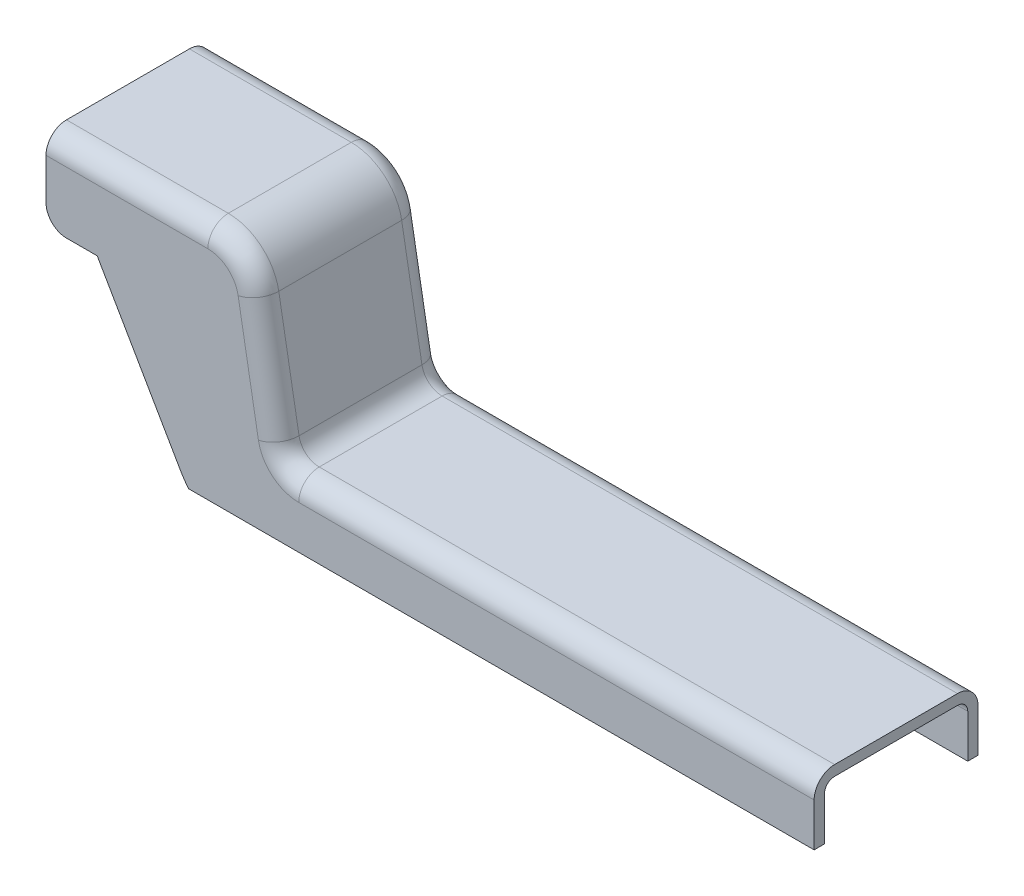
ISO-10303-21;
HEADER;
FILE_DESCRIPTION(('STEP AP214'),'2;1');
FILE_NAME('part.step','',(''),(''),'','','');
FILE_SCHEMA(('AUTOMOTIVE_DESIGN { 1 0 10303 214 1 1 1 1 }'));
ENDSEC;
DATA;
#1=APPLICATION_CONTEXT('core data for automotive mechanical design processes');
#2=APPLICATION_PROTOCOL_DEFINITION('international standard','automotive_design',2000,#1);
#3=PRODUCT_CONTEXT('',#1,'mechanical');
#4=PRODUCT('Part','Part','',(#3));
#5=PRODUCT_RELATED_PRODUCT_CATEGORY('part','',(#4));
#6=PRODUCT_DEFINITION_FORMATION('','',#4);
#7=PRODUCT_DEFINITION_CONTEXT('part definition',#1,'design');
#8=PRODUCT_DEFINITION('design','',#6,#7);
#9=PRODUCT_DEFINITION_SHAPE('','',#8);
#10=(LENGTH_UNIT() NAMED_UNIT(*) SI_UNIT(.MILLI.,.METRE.));
#11=(NAMED_UNIT(*) PLANE_ANGLE_UNIT() SI_UNIT($,.RADIAN.));
#12=(NAMED_UNIT(*) SI_UNIT($,.STERADIAN.) SOLID_ANGLE_UNIT());
#13=UNCERTAINTY_MEASURE_WITH_UNIT(LENGTH_MEASURE(1.E-05),#10,'distance_accuracy_value','');
#14=(GEOMETRIC_REPRESENTATION_CONTEXT(3) GLOBAL_UNCERTAINTY_ASSIGNED_CONTEXT((#13)) GLOBAL_UNIT_ASSIGNED_CONTEXT((#10,
#11,#12)) REPRESENTATION_CONTEXT('',''));
#15=CARTESIAN_POINT('',(0.,0.,0.));
#16=DIRECTION('',(0.,0.,1.));
#17=DIRECTION('',(1.,0.,0.));
#18=AXIS2_PLACEMENT_3D('',#15,#16,#17);
#19=CARTESIAN_POINT('',(-10.9776487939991,19.0138454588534,16.));
#20=DIRECTION('',(0.,1.,0.));
#21=DIRECTION('',(0.,0.,1.));
#22=AXIS2_PLACEMENT_3D('',#19,#20,#21);
#23=PLANE('',#22);
#24=DIRECTION('',(1.,0.,0.));
#25=VECTOR('',#24,1.);
#26=CARTESIAN_POINT('',(-13.9776487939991,19.0138454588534,1.));
#27=LINE('',#26,#25);
#28=CARTESIAN_POINT('',(-13.9776487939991,19.0138454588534,1.));
#29=VERTEX_POINT('',#28);
#30=CARTESIAN_POINT('',(-10.9776487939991,19.0138454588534,1.));
#31=VERTEX_POINT('',#30);
#32=EDGE_CURVE('E448',#29,#31,#27,.T.);
#33=ORIENTED_EDGE('',*,*,#32,.F.);
#34=DIRECTION('',(0.,0.,-1.));
#35=VECTOR('',#34,1.);
#36=CARTESIAN_POINT('',(-13.9776487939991,19.0138454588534,16.));
#37=LINE('',#36,#35);
#38=CARTESIAN_POINT('',(-13.9776487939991,19.0138454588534,0.));
#39=VERTEX_POINT('',#38);
#40=EDGE_CURVE('E304',#29,#39,#37,.T.);
#41=ORIENTED_EDGE('',*,*,#40,.T.);
#42=DIRECTION('',(1.,0.,0.));
#43=VECTOR('',#42,1.);
#44=CARTESIAN_POINT('',(-10.9776487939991,19.0138454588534,0.));
#45=LINE('',#44,#43);
#46=CARTESIAN_POINT('',(-10.9776487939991,19.0138454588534,0.));
#47=VERTEX_POINT('',#46);
#48=EDGE_CURVE('E411',#39,#47,#45,.T.);
#49=ORIENTED_EDGE('',*,*,#48,.T.);
#50=DIRECTION('',(0.,0.,-1.));
#51=VECTOR('',#50,1.);
#52=CARTESIAN_POINT('',(-10.9776487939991,19.0138454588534,16.));
#53=LINE('',#52,#51);
#54=EDGE_CURVE('E324',#31,#47,#53,.T.);
#55=ORIENTED_EDGE('',*,*,#54,.F.);
#56=EDGE_LOOP('',(#33,#41,#49,#55));
#57=FACE_BOUND('',#56,.T.);
#58=ADVANCED_FACE('F33',(#57),#23,.F.);
#59=CARTESIAN_POINT('',(-2.88675134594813,4.99999999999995,16.));
#60=DIRECTION('',(0.866025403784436,0.500000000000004,0.));
#61=DIRECTION('',(-0.500000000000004,0.866025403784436,0.));
#62=AXIS2_PLACEMENT_3D('',#59,#60,#61);
#63=PLANE('',#62);
#64=DIRECTION('',(0.500000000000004,-0.866025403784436,0.));
#65=VECTOR('',#64,1.);
#66=CARTESIAN_POINT('',(-12.5936741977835,21.8128835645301,1.));
#67=LINE('',#66,#65);
#68=CARTESIAN_POINT('',(-2.88675134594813,4.99999999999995,1.));
#69=VERTEX_POINT('',#68);
#70=EDGE_CURVE('E548',#31,#69,#67,.T.);
#71=ORIENTED_EDGE('',*,*,#70,.F.);
#72=ORIENTED_EDGE('',*,*,#54,.T.);
#73=DIRECTION('',(0.500000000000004,-0.866025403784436,0.));
#74=VECTOR('',#73,1.);
#75=CARTESIAN_POINT('',(-2.88675134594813,4.99999999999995,0.));
#76=LINE('',#75,#74);
#77=CARTESIAN_POINT('',(-2.88675134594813,4.99999999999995,0.));
#78=VERTEX_POINT('',#77);
#79=EDGE_CURVE('E293',#47,#78,#76,.T.);
#80=ORIENTED_EDGE('',*,*,#79,.T.);
#81=DIRECTION('',(0.,0.,-1.));
#82=VECTOR('',#81,1.);
#83=CARTESIAN_POINT('',(-2.88675134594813,4.99999999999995,16.));
#84=LINE('',#83,#82);
#85=EDGE_CURVE('E320',#69,#78,#84,.T.);
#86=ORIENTED_EDGE('',*,*,#85,.F.);
#87=EDGE_LOOP('',(#71,#72,#80,#86));
#88=FACE_BOUND('',#87,.T.);
#89=ADVANCED_FACE('F570',(#88),#63,.F.);
#90=CARTESIAN_POINT('',(5.77350269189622,10.,16.));
#91=DIRECTION('',(0.,0.,-1.));
#92=DIRECTION('',(-1.,0.,0.));
#93=AXIS2_PLACEMENT_3D('',#90,#91,#92);
#94=CYLINDRICAL_SURFACE('',#93,10.);
#95=CARTESIAN_POINT('',(5.77350269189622,10.,0.));
#96=DIRECTION('',(0.,0.,1.));
#97=DIRECTION('',(1.,0.,0.));
#98=AXIS2_PLACEMENT_3D('',#95,#96,#97);
#99=CIRCLE('',#98,10.);
#100=CARTESIAN_POINT('',(-2.05666971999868,3.78,0.));
#101=VERTEX_POINT('',#100);
#102=EDGE_CURVE('E288',#78,#101,#99,.T.);
#103=ORIENTED_EDGE('',*,*,#102,.T.);
#104=DIRECTION('',(0.,0.,-1.));
#105=VECTOR('',#104,1.);
#106=CARTESIAN_POINT('',(-2.05666971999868,3.78,16.));
#107=LINE('',#106,#105);
#108=CARTESIAN_POINT('',(-2.05666971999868,3.78,1.));
#109=VERTEX_POINT('',#108);
#110=EDGE_CURVE('E266',#101,#109,#107,.F.);
#111=ORIENTED_EDGE('',*,*,#110,.T.);
#112=CARTESIAN_POINT('',(5.77350269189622,10.,1.));
#113=DIRECTION('',(0.,0.,-1.));
#114=DIRECTION('',(-1.,0.,0.));
#115=AXIS2_PLACEMENT_3D('',#112,#113,#114);
#116=CIRCLE('',#115,10.);
#117=EDGE_CURVE('E518',#69,#109,#116,.F.);
#118=ORIENTED_EDGE('',*,*,#117,.F.);
#119=ORIENTED_EDGE('',*,*,#85,.T.);
#120=EDGE_LOOP('',(#103,#111,#118,#119));
#121=FACE_BOUND('',#120,.T.);
#122=ADVANCED_FACE('F574',(#121),#94,.T.);
#123=CARTESIAN_POINT('',(59.0223512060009,10.,16.));
#124=DIRECTION('',(-1.,0.,0.));
#125=DIRECTION('',(0.,-1.,0.));
#126=AXIS2_PLACEMENT_3D('',#123,#124,#125);
#127=PLANE('',#126);
#128=DIRECTION('',(0.,1.,0.));
#129=VECTOR('',#128,1.);
#130=CARTESIAN_POINT('',(59.0223512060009,10.,16.));
#131=LINE('',#130,#129);
#132=CARTESIAN_POINT('',(59.0223512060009,3.78,16.));
#133=VERTEX_POINT('',#132);
#134=CARTESIAN_POINT('',(59.0223512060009,8.,16.));
#135=VERTEX_POINT('',#134);
#136=EDGE_CURVE('E558',#133,#135,#131,.T.);
#137=ORIENTED_EDGE('',*,*,#136,.F.);
#138=DIRECTION('',(0.,0.,1.));
#139=VECTOR('',#138,1.);
#140=CARTESIAN_POINT('',(59.0223512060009,3.78,0.));
#141=LINE('',#140,#139);
#142=CARTESIAN_POINT('',(59.0223512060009,3.78,15.));
#143=VERTEX_POINT('',#142);
#144=EDGE_CURVE('E271',#143,#133,#141,.T.);
#145=ORIENTED_EDGE('',*,*,#144,.F.);
#146=DIRECTION('',(0.,1.,0.));
#147=VECTOR('',#146,1.);
#148=CARTESIAN_POINT('',(59.0223512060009,21.0138454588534,15.));
#149=LINE('',#148,#147);
#150=CARTESIAN_POINT('',(59.0223512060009,8.,15.));
#151=VERTEX_POINT('',#150);
#152=EDGE_CURVE('E524',#143,#151,#149,.T.);
#153=ORIENTED_EDGE('',*,*,#152,.T.);
#154=CARTESIAN_POINT('',(59.0223512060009,8.,14.));
#155=DIRECTION('',(-1.,0.,0.));
#156=DIRECTION('',(0.,-1.,0.));
#157=AXIS2_PLACEMENT_3D('',#154,#155,#156);
#158=CIRCLE('',#157,1.);
#159=CARTESIAN_POINT('',(59.0223512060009,9.,14.));
#160=VERTEX_POINT('',#159);
#161=EDGE_CURVE('E501',#160,#151,#158,.F.);
#162=ORIENTED_EDGE('',*,*,#161,.F.);
#163=DIRECTION('',(0.,0.,-1.));
#164=VECTOR('',#163,1.);
#165=CARTESIAN_POINT('',(59.0223512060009,9.,16.));
#166=LINE('',#165,#164);
#167=CARTESIAN_POINT('',(59.0223512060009,9.,2.));
#168=VERTEX_POINT('',#167);
#169=EDGE_CURVE('E453',#160,#168,#166,.T.);
#170=ORIENTED_EDGE('',*,*,#169,.T.);
#171=CARTESIAN_POINT('',(59.0223512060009,8.,2.));
#172=DIRECTION('',(-1.,0.,0.));
#173=DIRECTION('',(0.,-1.,0.));
#174=AXIS2_PLACEMENT_3D('',#171,#172,#173);
#175=CIRCLE('',#174,1.);
#176=CARTESIAN_POINT('',(59.0223512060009,8.,1.));
#177=VERTEX_POINT('',#176);
#178=EDGE_CURVE('E384',#177,#168,#175,.F.);
#179=ORIENTED_EDGE('',*,*,#178,.F.);
#180=DIRECTION('',(0.,1.,0.));
#181=VECTOR('',#180,1.);
#182=CARTESIAN_POINT('',(59.0223512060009,21.0138454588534,1.));
#183=LINE('',#182,#181);
#184=CARTESIAN_POINT('',(59.0223512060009,3.78,1.));
#185=VERTEX_POINT('',#184);
#186=EDGE_CURVE('E281',#185,#177,#183,.T.);
#187=ORIENTED_EDGE('',*,*,#186,.F.);
#188=CARTESIAN_POINT('',(59.0223512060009,3.78,0.));
#189=VERTEX_POINT('',#188);
#190=EDGE_CURVE('E56',#189,#185,#141,.T.);
#191=ORIENTED_EDGE('',*,*,#190,.F.);
#192=DIRECTION('',(0.,1.,0.));
#193=VECTOR('',#192,1.);
#194=CARTESIAN_POINT('',(59.0223512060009,10.,0.));
#195=LINE('',#194,#193);
#196=CARTESIAN_POINT('',(59.0223512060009,8.,0.));
#197=VERTEX_POINT('',#196);
#198=EDGE_CURVE('E278',#189,#197,#195,.T.);
#199=ORIENTED_EDGE('',*,*,#198,.T.);
#200=CARTESIAN_POINT('',(59.0223512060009,8.,2.));
#201=DIRECTION('',(-1.,0.,0.));
#202=DIRECTION('',(0.,-1.,0.));
#203=AXIS2_PLACEMENT_3D('',#200,#201,#202);
#204=CIRCLE('',#203,2.);
#205=CARTESIAN_POINT('',(59.0223512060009,10.,2.));
#206=VERTEX_POINT('',#205);
#207=EDGE_CURVE('E377',#197,#206,#204,.F.);
#208=ORIENTED_EDGE('',*,*,#207,.T.);
#209=DIRECTION('',(0.,0.,-1.));
#210=VECTOR('',#209,1.);
#211=CARTESIAN_POINT('',(59.0223512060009,10.,16.));
#212=LINE('',#211,#210);
#213=CARTESIAN_POINT('',(59.0223512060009,10.,14.));
#214=VERTEX_POINT('',#213);
#215=EDGE_CURVE('E317',#214,#206,#212,.T.);
#216=ORIENTED_EDGE('',*,*,#215,.F.);
#217=CARTESIAN_POINT('',(59.0223512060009,8.,14.));
#218=DIRECTION('',(-1.,0.,0.));
#219=DIRECTION('',(0.,-1.,0.));
#220=AXIS2_PLACEMENT_3D('',#217,#218,#219);
#221=CIRCLE('',#220,2.);
#222=EDGE_CURVE('E374',#214,#135,#221,.F.);
#223=ORIENTED_EDGE('',*,*,#222,.T.);
#224=EDGE_LOOP('',(#137,#145,#153,#162,#170,#179,#187,#191,#199,#208,#216,#223));
#225=FACE_BOUND('',#224,.T.);
#226=ADVANCED_FACE('F277',(#225),#127,.F.);
#227=CARTESIAN_POINT('',(-15.9776487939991,21.0138454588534,16.));
#228=DIRECTION('',(1.,0.,0.));
#229=DIRECTION('',(0.,0.,-1.));
#230=AXIS2_PLACEMENT_3D('',#227,#228,#229);
#231=PLANE('',#230);
#232=DIRECTION('',(0.,-1.,0.));
#233=VECTOR('',#232,1.);
#234=CARTESIAN_POINT('',(-15.9776487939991,21.0138454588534,1.));
#235=LINE('',#234,#233);
#236=CARTESIAN_POINT('',(-15.9776487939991,25.0138454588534,1.));
#237=VERTEX_POINT('',#236);
#238=CARTESIAN_POINT('',(-15.9776487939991,21.0138454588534,1.));
#239=VERTEX_POINT('',#238);
#240=EDGE_CURVE('E517',#237,#239,#235,.T.);
#241=ORIENTED_EDGE('',*,*,#240,.F.);
#242=CARTESIAN_POINT('',(-15.9776487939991,25.0138454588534,2.));
#243=DIRECTION('',(1.,0.,0.));
#244=DIRECTION('',(0.,0.,-1.));
#245=AXIS2_PLACEMENT_3D('',#242,#243,#244);
#246=CIRCLE('',#245,1.);
#247=CARTESIAN_POINT('',(-15.9776487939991,26.0138454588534,2.));
#248=VERTEX_POINT('',#247);
#249=EDGE_CURVE('E493',#248,#237,#246,.F.);
#250=ORIENTED_EDGE('',*,*,#249,.F.);
#251=DIRECTION('',(0.,0.,-1.));
#252=VECTOR('',#251,1.);
#253=CARTESIAN_POINT('',(-15.9776487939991,26.0138454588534,16.));
#254=LINE('',#253,#252);
#255=CARTESIAN_POINT('',(-15.9776487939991,26.0138454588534,14.));
#256=VERTEX_POINT('',#255);
#257=EDGE_CURVE('E464',#256,#248,#254,.T.);
#258=ORIENTED_EDGE('',*,*,#257,.F.);
#259=CARTESIAN_POINT('',(-15.9776487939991,25.0138454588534,14.));
#260=DIRECTION('',(1.,0.,0.));
#261=DIRECTION('',(0.,0.,-1.));
#262=AXIS2_PLACEMENT_3D('',#259,#260,#261);
#263=CIRCLE('',#262,1.);
#264=CARTESIAN_POINT('',(-15.9776487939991,25.0138454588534,15.));
#265=VERTEX_POINT('',#264);
#266=EDGE_CURVE('E475',#265,#256,#263,.F.);
#267=ORIENTED_EDGE('',*,*,#266,.F.);
#268=DIRECTION('',(0.,-1.,0.));
#269=VECTOR('',#268,1.);
#270=CARTESIAN_POINT('',(-15.9776487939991,21.0138454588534,15.));
#271=LINE('',#270,#269);
#272=CARTESIAN_POINT('',(-15.9776487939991,21.0138454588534,15.));
#273=VERTEX_POINT('',#272);
#274=EDGE_CURVE('E526',#265,#273,#271,.T.);
#275=ORIENTED_EDGE('',*,*,#274,.T.);
#276=DIRECTION('',(0.,0.,-1.));
#277=VECTOR('',#276,1.);
#278=CARTESIAN_POINT('',(-15.9776487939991,21.0138454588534,16.));
#279=LINE('',#278,#277);
#280=CARTESIAN_POINT('',(-15.9776487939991,21.0138454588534,16.));
#281=VERTEX_POINT('',#280);
#282=EDGE_CURVE('E305',#281,#273,#279,.T.);
#283=ORIENTED_EDGE('',*,*,#282,.F.);
#284=DIRECTION('',(0.,-1.,0.));
#285=VECTOR('',#284,1.);
#286=CARTESIAN_POINT('',(-15.9776487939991,21.0138454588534,16.));
#287=LINE('',#286,#285);
#288=CARTESIAN_POINT('',(-15.9776487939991,25.0138454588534,16.));
#289=VERTEX_POINT('',#288);
#290=EDGE_CURVE('E560',#289,#281,#287,.T.);
#291=ORIENTED_EDGE('',*,*,#290,.F.);
#292=CARTESIAN_POINT('',(-15.9776487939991,25.0138454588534,14.));
#293=DIRECTION('',(1.,0.,0.));
#294=DIRECTION('',(0.,0.,-1.));
#295=AXIS2_PLACEMENT_3D('',#292,#293,#294);
#296=CIRCLE('',#295,2.);
#297=CARTESIAN_POINT('',(-15.9776487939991,27.0138454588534,14.));
#298=VERTEX_POINT('',#297);
#299=EDGE_CURVE('E333',#289,#298,#296,.F.);
#300=ORIENTED_EDGE('',*,*,#299,.T.);
#301=DIRECTION('',(0.,0.,-1.));
#302=VECTOR('',#301,1.);
#303=CARTESIAN_POINT('',(-15.9776487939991,27.0138454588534,16.));
#304=LINE('',#303,#302);
#305=CARTESIAN_POINT('',(-15.9776487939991,27.0138454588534,2.));
#306=VERTEX_POINT('',#305);
#307=EDGE_CURVE('E308',#298,#306,#304,.T.);
#308=ORIENTED_EDGE('',*,*,#307,.T.);
#309=CARTESIAN_POINT('',(-15.9776487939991,25.0138454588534,2.));
#310=DIRECTION('',(1.,0.,0.));
#311=DIRECTION('',(0.,0.,-1.));
#312=AXIS2_PLACEMENT_3D('',#309,#310,#311);
#313=CIRCLE('',#312,2.);
#314=CARTESIAN_POINT('',(-15.9776487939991,25.0138454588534,0.));
#315=VERTEX_POINT('',#314);
#316=EDGE_CURVE('E335',#306,#315,#313,.F.);
#317=ORIENTED_EDGE('',*,*,#316,.T.);
#318=DIRECTION('',(0.,-1.,0.));
#319=VECTOR('',#318,1.);
#320=CARTESIAN_POINT('',(-15.9776487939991,21.0138454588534,0.));
#321=LINE('',#320,#319);
#322=CARTESIAN_POINT('',(-15.9776487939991,21.0138454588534,0.));
#323=VERTEX_POINT('',#322);
#324=EDGE_CURVE('E287',#315,#323,#321,.T.);
#325=ORIENTED_EDGE('',*,*,#324,.T.);
#326=EDGE_CURVE('E303',#239,#323,#279,.T.);
#327=ORIENTED_EDGE('',*,*,#326,.F.);
#328=EDGE_LOOP('',(#241,#250,#258,#267,#275,#283,#291,#300,#308,#317,#325,#327));
#329=FACE_BOUND('',#328,.T.);
#330=ADVANCED_FACE('F590',(#329),#231,.F.);
#331=CARTESIAN_POINT('',(-13.9776487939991,21.0138454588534,16.));
#332=DIRECTION('',(0.,0.,-1.));
#333=DIRECTION('',(-1.,0.,0.));
#334=AXIS2_PLACEMENT_3D('',#331,#332,#333);
#335=CYLINDRICAL_SURFACE('',#334,2.);
#336=CARTESIAN_POINT('',(-13.9776487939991,21.0138454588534,1.));
#337=DIRECTION('',(0.,0.,-1.));
#338=DIRECTION('',(-1.,0.,0.));
#339=AXIS2_PLACEMENT_3D('',#336,#337,#338);
#340=CIRCLE('',#339,2.);
#341=EDGE_CURVE('E535',#239,#29,#340,.F.);
#342=ORIENTED_EDGE('',*,*,#341,.F.);
#343=ORIENTED_EDGE('',*,*,#326,.T.);
#344=CARTESIAN_POINT('',(-13.9776487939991,21.0138454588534,0.));
#345=DIRECTION('',(0.,0.,1.));
#346=DIRECTION('',(-1.,0.,0.));
#347=AXIS2_PLACEMENT_3D('',#344,#345,#346);
#348=CIRCLE('',#347,2.);
#349=EDGE_CURVE('E291',#323,#39,#348,.T.);
#350=ORIENTED_EDGE('',*,*,#349,.T.);
#351=ORIENTED_EDGE('',*,*,#40,.F.);
#352=EDGE_LOOP('',(#342,#343,#350,#351));
#353=FACE_BOUND('',#352,.T.);
#354=ADVANCED_FACE('F586',(#353),#335,.T.);
#355=CARTESIAN_POINT('',(-13.9776487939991,19.0138454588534,16.));
#356=VERTEX_POINT('',#355);
#357=CARTESIAN_POINT('',(-13.9776487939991,19.0138454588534,15.));
#358=VERTEX_POINT('',#357);
#359=EDGE_CURVE('E300',#356,#358,#37,.T.);
#360=ORIENTED_EDGE('',*,*,#359,.T.);
#361=DIRECTION('',(1.,0.,0.));
#362=VECTOR('',#361,1.);
#363=CARTESIAN_POINT('',(-13.9776487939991,19.0138454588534,15.));
#364=LINE('',#363,#362);
#365=CARTESIAN_POINT('',(-10.9776487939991,19.0138454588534,15.));
#366=VERTEX_POINT('',#365);
#367=EDGE_CURVE('E532',#358,#366,#364,.T.);
#368=ORIENTED_EDGE('',*,*,#367,.T.);
#369=CARTESIAN_POINT('',(-10.9776487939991,19.0138454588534,16.));
#370=VERTEX_POINT('',#369);
#371=EDGE_CURVE('E325',#370,#366,#53,.T.);
#372=ORIENTED_EDGE('',*,*,#371,.F.);
#373=DIRECTION('',(1.,0.,0.));
#374=VECTOR('',#373,1.);
#375=CARTESIAN_POINT('',(-10.9776487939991,19.0138454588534,16.));
#376=LINE('',#375,#374);
#377=EDGE_CURVE('E299',#356,#370,#376,.T.);
#378=ORIENTED_EDGE('',*,*,#377,.F.);
#379=EDGE_LOOP('',(#360,#368,#372,#378));
#380=FACE_BOUND('',#379,.T.);
#381=ADVANCED_FACE('F665',(#380),#23,.F.);
#382=ORIENTED_EDGE('',*,*,#371,.T.);
#383=DIRECTION('',(0.500000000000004,-0.866025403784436,0.));
#384=VECTOR('',#383,1.);
#385=CARTESIAN_POINT('',(-12.5936741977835,21.8128835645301,15.));
#386=LINE('',#385,#384);
#387=CARTESIAN_POINT('',(-2.88675134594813,4.99999999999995,15.));
#388=VERTEX_POINT('',#387);
#389=EDGE_CURVE('E529',#366,#388,#386,.T.);
#390=ORIENTED_EDGE('',*,*,#389,.T.);
#391=CARTESIAN_POINT('',(-2.88675134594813,4.99999999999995,16.));
#392=VERTEX_POINT('',#391);
#393=EDGE_CURVE('E321',#392,#388,#84,.T.);
#394=ORIENTED_EDGE('',*,*,#393,.F.);
#395=DIRECTION('',(0.500000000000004,-0.866025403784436,0.));
#396=VECTOR('',#395,1.);
#397=CARTESIAN_POINT('',(-2.88675134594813,4.99999999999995,16.));
#398=LINE('',#397,#396);
#399=EDGE_CURVE('E554',#370,#392,#398,.T.);
#400=ORIENTED_EDGE('',*,*,#399,.F.);
#401=EDGE_LOOP('',(#382,#390,#394,#400));
#402=FACE_BOUND('',#401,.T.);
#403=ADVANCED_FACE('F667',(#402),#63,.F.);
#404=CARTESIAN_POINT('',(5.77350269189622,10.,15.));
#405=DIRECTION('',(0.,0.,-1.));
#406=DIRECTION('',(-1.,0.,0.));
#407=AXIS2_PLACEMENT_3D('',#404,#405,#406);
#408=CIRCLE('',#407,10.);
#409=CARTESIAN_POINT('',(-2.05666971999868,3.78,15.));
#410=VERTEX_POINT('',#409);
#411=EDGE_CURVE('E527',#388,#410,#408,.F.);
#412=ORIENTED_EDGE('',*,*,#411,.T.);
#413=DIRECTION('',(0.,0.,-1.));
#414=VECTOR('',#413,1.);
#415=CARTESIAN_POINT('',(-2.05666971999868,3.78,16.));
#416=LINE('',#415,#414);
#417=CARTESIAN_POINT('',(-2.05666971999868,3.78,16.));
#418=VERTEX_POINT('',#417);
#419=EDGE_CURVE('E48',#410,#418,#416,.F.);
#420=ORIENTED_EDGE('',*,*,#419,.T.);
#421=CARTESIAN_POINT('',(5.77350269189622,10.,16.));
#422=DIRECTION('',(0.,0.,1.));
#423=DIRECTION('',(1.,0.,0.));
#424=AXIS2_PLACEMENT_3D('',#421,#422,#423);
#425=CIRCLE('',#424,10.);
#426=EDGE_CURVE('E556',#392,#418,#425,.T.);
#427=ORIENTED_EDGE('',*,*,#426,.F.);
#428=ORIENTED_EDGE('',*,*,#393,.T.);
#429=EDGE_LOOP('',(#412,#420,#427,#428));
#430=FACE_BOUND('',#429,.T.);
#431=ADVANCED_FACE('F668',(#430),#94,.T.);
#432=CARTESIAN_POINT('',(7.02235120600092,10.,16.));
#433=DIRECTION('',(0.,-1.,0.));
#434=DIRECTION('',(1.,0.,0.));
#435=AXIS2_PLACEMENT_3D('',#432,#433,#434);
#436=PLANE('',#435);
#437=ORIENTED_EDGE('',*,*,#215,.T.);
#438=DIRECTION('',(-1.,0.,0.));
#439=VECTOR('',#438,1.);
#440=CARTESIAN_POINT('',(7.02235120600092,10.,2.));
#441=LINE('',#440,#439);
#442=CARTESIAN_POINT('',(8.70055046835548,10.,2.));
#443=VERTEX_POINT('',#442);
#444=EDGE_CURVE('E372',#206,#443,#441,.T.);
#445=ORIENTED_EDGE('',*,*,#444,.T.);
#446=DIRECTION('',(0.,0.,-1.));
#447=VECTOR('',#446,1.);
#448=CARTESIAN_POINT('',(8.70055046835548,10.,16.));
#449=LINE('',#448,#447);
#450=CARTESIAN_POINT('',(8.70055046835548,10.,14.));
#451=VERTEX_POINT('',#450);
#452=EDGE_CURVE('E370',#443,#451,#449,.F.);
#453=ORIENTED_EDGE('',*,*,#452,.T.);
#454=DIRECTION('',(-1.,0.,0.));
#455=VECTOR('',#454,1.);
#456=CARTESIAN_POINT('',(7.02235120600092,10.,14.));
#457=LINE('',#456,#455);
#458=EDGE_CURVE('E368',#451,#214,#457,.F.);
#459=ORIENTED_EDGE('',*,*,#458,.T.);
#460=EDGE_LOOP('',(#437,#445,#453,#459));
#461=FACE_BOUND('',#460,.T.);
#462=ADVANCED_FACE('F622',(#461),#436,.F.);
#463=CARTESIAN_POINT('',(4.75089181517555,22.882086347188,16.));
#464=DIRECTION('',(-0.984807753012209,-0.173648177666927,0.));
#465=DIRECTION('',(0.173648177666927,-0.984807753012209,0.));
#466=AXIS2_PLACEMENT_3D('',#463,#464,#465);
#467=PLANE('',#466);
#468=DIRECTION('',(0.,0.,-1.));
#469=VECTOR('',#468,1.);
#470=CARTESIAN_POINT('',(6.73093496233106,11.6527036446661,0.));
#471=LINE('',#470,#469);
#472=CARTESIAN_POINT('',(6.73093496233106,11.6527036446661,14.));
#473=VERTEX_POINT('',#472);
#474=CARTESIAN_POINT('',(6.73093496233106,11.6527036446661,2.));
#475=VERTEX_POINT('',#474);
#476=EDGE_CURVE('E353',#473,#475,#471,.T.);
#477=ORIENTED_EDGE('',*,*,#476,.T.);
#478=DIRECTION('',(-0.173648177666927,0.984807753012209,0.));
#479=VECTOR('',#478,1.);
#480=CARTESIAN_POINT('',(4.75089181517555,22.882086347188,2.));
#481=LINE('',#480,#479);
#482=CARTESIAN_POINT('',(4.75089181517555,22.882086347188,2.));
#483=VERTEX_POINT('',#482);
#484=EDGE_CURVE('E355',#475,#483,#481,.T.);
#485=ORIENTED_EDGE('',*,*,#484,.T.);
#486=DIRECTION('',(0.,0.,-1.));
#487=VECTOR('',#486,1.);
#488=CARTESIAN_POINT('',(4.75089181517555,22.882086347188,16.));
#489=LINE('',#488,#487);
#490=CARTESIAN_POINT('',(4.75089181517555,22.882086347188,14.));
#491=VERTEX_POINT('',#490);
#492=EDGE_CURVE('E314',#491,#483,#489,.T.);
#493=ORIENTED_EDGE('',*,*,#492,.F.);
#494=DIRECTION('',(-0.173648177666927,0.984807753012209,0.));
#495=VECTOR('',#494,1.);
#496=CARTESIAN_POINT('',(4.75089181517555,22.882086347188,14.));
#497=LINE('',#496,#495);
#498=EDGE_CURVE('E351',#491,#473,#497,.F.);
#499=ORIENTED_EDGE('',*,*,#498,.T.);
#500=EDGE_LOOP('',(#477,#485,#493,#499));
#501=FACE_BOUND('',#500,.T.);
#502=ADVANCED_FACE('F636',(#501),#467,.F.);
#503=CARTESIAN_POINT('',(-0.173146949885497,22.0138454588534,16.));
#504=DIRECTION('',(0.,0.,-1.));
#505=DIRECTION('',(-1.,0.,0.));
#506=AXIS2_PLACEMENT_3D('',#503,#504,#505);
#507=CYLINDRICAL_SURFACE('',#506,5.);
#508=ORIENTED_EDGE('',*,*,#492,.T.);
#509=CARTESIAN_POINT('',(-0.173146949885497,22.0138454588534,2.));
#510=DIRECTION('',(0.,0.,-1.));
#511=DIRECTION('',(-1.,0.,0.));
#512=AXIS2_PLACEMENT_3D('',#509,#510,#511);
#513=CIRCLE('',#512,5.);
#514=CARTESIAN_POINT('',(-0.173146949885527,27.0138454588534,2.));
#515=VERTEX_POINT('',#514);
#516=EDGE_CURVE('E349',#483,#515,#513,.F.);
#517=ORIENTED_EDGE('',*,*,#516,.T.);
#518=DIRECTION('',(0.,0.,-1.));
#519=VECTOR('',#518,1.);
#520=CARTESIAN_POINT('',(-0.173146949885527,27.0138454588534,16.));
#521=LINE('',#520,#519);
#522=CARTESIAN_POINT('',(-0.173146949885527,27.0138454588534,14.));
#523=VERTEX_POINT('',#522);
#524=EDGE_CURVE('E311',#523,#515,#521,.T.);
#525=ORIENTED_EDGE('',*,*,#524,.F.);
#526=CARTESIAN_POINT('',(-0.173146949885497,22.0138454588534,14.));
#527=DIRECTION('',(0.,0.,-1.));
#528=DIRECTION('',(-1.,0.,0.));
#529=AXIS2_PLACEMENT_3D('',#526,#527,#528);
#530=CIRCLE('',#529,5.);
#531=EDGE_CURVE('E347',#523,#491,#530,.T.);
#532=ORIENTED_EDGE('',*,*,#531,.T.);
#533=EDGE_LOOP('',(#508,#517,#525,#532));
#534=FACE_BOUND('',#533,.T.);
#535=ADVANCED_FACE('F746',(#534),#507,.T.);
#536=CARTESIAN_POINT('',(-15.9776487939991,27.0138454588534,16.));
#537=DIRECTION('',(0.,-1.,0.));
#538=DIRECTION('',(0.,0.,-1.));
#539=AXIS2_PLACEMENT_3D('',#536,#537,#538);
#540=PLANE('',#539);
#541=ORIENTED_EDGE('',*,*,#524,.T.);
#542=DIRECTION('',(-1.,0.,0.));
#543=VECTOR('',#542,1.);
#544=CARTESIAN_POINT('',(-15.9776487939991,27.0138454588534,2.));
#545=LINE('',#544,#543);
#546=EDGE_CURVE('E330',#515,#306,#545,.T.);
#547=ORIENTED_EDGE('',*,*,#546,.T.);
#548=ORIENTED_EDGE('',*,*,#307,.F.);
#549=DIRECTION('',(-1.,0.,0.));
#550=VECTOR('',#549,1.);
#551=CARTESIAN_POINT('',(-15.9776487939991,27.0138454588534,14.));
#552=LINE('',#551,#550);
#553=EDGE_CURVE('E328',#298,#523,#552,.F.);
#554=ORIENTED_EDGE('',*,*,#553,.T.);
#555=EDGE_LOOP('',(#541,#547,#548,#554));
#556=FACE_BOUND('',#555,.T.);
#557=ADVANCED_FACE('F596',(#556),#540,.F.);
#558=ORIENTED_EDGE('',*,*,#282,.T.);
#559=CARTESIAN_POINT('',(-13.9776487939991,21.0138454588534,15.));
#560=DIRECTION('',(0.,0.,-1.));
#561=DIRECTION('',(-1.,0.,0.));
#562=AXIS2_PLACEMENT_3D('',#559,#560,#561);
#563=CIRCLE('',#562,2.);
#564=EDGE_CURVE('E536',#273,#358,#563,.F.);
#565=ORIENTED_EDGE('',*,*,#564,.T.);
#566=ORIENTED_EDGE('',*,*,#359,.F.);
#567=CARTESIAN_POINT('',(-13.9776487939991,21.0138454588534,16.));
#568=DIRECTION('',(0.,0.,1.));
#569=DIRECTION('',(-1.,0.,0.));
#570=AXIS2_PLACEMENT_3D('',#567,#568,#569);
#571=CIRCLE('',#570,2.);
#572=EDGE_CURVE('E562',#281,#356,#571,.T.);
#573=ORIENTED_EDGE('',*,*,#572,.F.);
#574=EDGE_LOOP('',(#558,#565,#566,#573));
#575=FACE_BOUND('',#574,.T.);
#576=ADVANCED_FACE('F660',(#575),#335,.T.);
#577=CARTESIAN_POINT('',(-13.9776487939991,21.0138454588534,16.));
#578=DIRECTION('',(0.,0.,-1.));
#579=DIRECTION('',(-1.,0.,0.));
#580=AXIS2_PLACEMENT_3D('',#577,#578,#579);
#581=PLANE('',#580);
#582=ORIENTED_EDGE('',*,*,#426,.T.);
#583=DIRECTION('',(-1.,0.,0.));
#584=VECTOR('',#583,1.);
#585=CARTESIAN_POINT('',(-2.18238401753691,3.78,16.));
#586=LINE('',#585,#584);
#587=EDGE_CURVE('E272',#133,#418,#586,.T.);
#588=ORIENTED_EDGE('',*,*,#587,.F.);
#589=ORIENTED_EDGE('',*,*,#136,.T.);
#590=DIRECTION('',(-1.,0.,0.));
#591=VECTOR('',#590,1.);
#592=CARTESIAN_POINT('',(-13.9776487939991,8.,16.));
#593=LINE('',#592,#591);
#594=CARTESIAN_POINT('',(8.70055046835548,8.,16.));
#595=VERTEX_POINT('',#594);
#596=EDGE_CURVE('E360',#135,#595,#593,.T.);
#597=ORIENTED_EDGE('',*,*,#596,.T.);
#598=CARTESIAN_POINT('',(8.70055046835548,12.,16.));
#599=DIRECTION('',(0.,0.,-1.));
#600=DIRECTION('',(-1.,0.,0.));
#601=AXIS2_PLACEMENT_3D('',#598,#599,#600);
#602=CIRCLE('',#601,4.);
#603=CARTESIAN_POINT('',(4.76131945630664,11.3054072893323,16.));
#604=VERTEX_POINT('',#603);
#605=EDGE_CURVE('E357',#604,#595,#602,.F.);
#606=ORIENTED_EDGE('',*,*,#605,.F.);
#607=DIRECTION('',(-0.173648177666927,0.984807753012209,0.));
#608=VECTOR('',#607,1.);
#609=CARTESIAN_POINT('',(2.53602971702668,23.9256525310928,16.));
#610=LINE('',#609,#608);
#611=CARTESIAN_POINT('',(2.78127630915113,22.5347899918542,16.));
#612=VERTEX_POINT('',#611);
#613=EDGE_CURVE('E362',#604,#612,#610,.T.);
#614=ORIENTED_EDGE('',*,*,#613,.T.);
#615=CARTESIAN_POINT('',(-0.173146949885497,22.0138454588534,16.));
#616=DIRECTION('',(0.,0.,-1.));
#617=DIRECTION('',(-1.,0.,0.));
#618=AXIS2_PLACEMENT_3D('',#615,#616,#617);
#619=CIRCLE('',#618,3.);
#620=CARTESIAN_POINT('',(-0.173146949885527,25.0138454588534,16.));
#621=VERTEX_POINT('',#620);
#622=EDGE_CURVE('E364',#612,#621,#619,.F.);
#623=ORIENTED_EDGE('',*,*,#622,.T.);
#624=DIRECTION('',(-1.,0.,0.));
#625=VECTOR('',#624,1.);
#626=CARTESIAN_POINT('',(-13.9776487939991,25.0138454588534,16.));
#627=LINE('',#626,#625);
#628=EDGE_CURVE('E366',#621,#289,#627,.T.);
#629=ORIENTED_EDGE('',*,*,#628,.T.);
#630=ORIENTED_EDGE('',*,*,#290,.T.);
#631=ORIENTED_EDGE('',*,*,#572,.T.);
#632=ORIENTED_EDGE('',*,*,#377,.T.);
#633=ORIENTED_EDGE('',*,*,#399,.T.);
#634=EDGE_LOOP('',(#582,#588,#589,#597,#606,#614,#623,#629,#630,#631,#632,#633));
#635=FACE_BOUND('',#634,.T.);
#636=ADVANCED_FACE('F646',(#635),#581,.F.);
#637=CARTESIAN_POINT('',(-13.9776487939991,21.0138454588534,0.));
#638=DIRECTION('',(0.,0.,-1.));
#639=DIRECTION('',(-1.,0.,0.));
#640=AXIS2_PLACEMENT_3D('',#637,#638,#639);
#641=PLANE('',#640);
#642=DIRECTION('',(-1.,0.,0.));
#643=VECTOR('',#642,1.);
#644=CARTESIAN_POINT('',(-2.18238401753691,3.78,0.));
#645=LINE('',#644,#643);
#646=EDGE_CURVE('E263',#189,#101,#645,.T.);
#647=ORIENTED_EDGE('',*,*,#646,.T.);
#648=ORIENTED_EDGE('',*,*,#102,.F.);
#649=ORIENTED_EDGE('',*,*,#79,.F.);
#650=ORIENTED_EDGE('',*,*,#48,.F.);
#651=ORIENTED_EDGE('',*,*,#349,.F.);
#652=ORIENTED_EDGE('',*,*,#324,.F.);
#653=DIRECTION('',(-1.,0.,0.));
#654=VECTOR('',#653,1.);
#655=CARTESIAN_POINT('',(-0.173146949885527,25.0138454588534,0.));
#656=LINE('',#655,#654);
#657=CARTESIAN_POINT('',(-0.173146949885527,25.0138454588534,0.));
#658=VERTEX_POINT('',#657);
#659=EDGE_CURVE('E345',#315,#658,#656,.F.);
#660=ORIENTED_EDGE('',*,*,#659,.T.);
#661=CARTESIAN_POINT('',(-0.173146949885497,22.0138454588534,0.));
#662=DIRECTION('',(0.,0.,-1.));
#663=DIRECTION('',(-1.,0.,0.));
#664=AXIS2_PLACEMENT_3D('',#661,#662,#663);
#665=CIRCLE('',#664,3.);
#666=CARTESIAN_POINT('',(2.78127630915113,22.5347899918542,0.));
#667=VERTEX_POINT('',#666);
#668=EDGE_CURVE('E343',#658,#667,#665,.T.);
#669=ORIENTED_EDGE('',*,*,#668,.T.);
#670=DIRECTION('',(-0.173648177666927,0.984807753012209,0.));
#671=VECTOR('',#670,1.);
#672=CARTESIAN_POINT('',(5.0527356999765,9.65270364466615,0.));
#673=LINE('',#672,#671);
#674=CARTESIAN_POINT('',(4.76131945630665,11.3054072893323,0.));
#675=VERTEX_POINT('',#674);
#676=EDGE_CURVE('E341',#667,#675,#673,.F.);
#677=ORIENTED_EDGE('',*,*,#676,.T.);
#678=CARTESIAN_POINT('',(8.70055046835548,12.,0.));
#679=DIRECTION('',(0.,0.,-1.));
#680=DIRECTION('',(-1.,0.,0.));
#681=AXIS2_PLACEMENT_3D('',#678,#679,#680);
#682=CIRCLE('',#681,4.);
#683=CARTESIAN_POINT('',(8.70055046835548,8.,0.));
#684=VERTEX_POINT('',#683);
#685=EDGE_CURVE('E338',#684,#675,#682,.T.);
#686=ORIENTED_EDGE('',*,*,#685,.F.);
#687=DIRECTION('',(-1.,0.,0.));
#688=VECTOR('',#687,1.);
#689=CARTESIAN_POINT('',(59.0223512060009,8.,0.));
#690=LINE('',#689,#688);
#691=EDGE_CURVE('E285',#684,#197,#690,.F.);
#692=ORIENTED_EDGE('',*,*,#691,.T.);
#693=ORIENTED_EDGE('',*,*,#198,.F.);
#694=EDGE_LOOP('',(#647,#648,#649,#650,#651,#652,#660,#669,#677,#686,#692,#693));
#695=FACE_BOUND('',#694,.T.);
#696=ADVANCED_FACE('F283',(#695),#641,.T.);
#697=CARTESIAN_POINT('',(-13.9776487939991,25.0138454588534,14.));
#698=DIRECTION('',(-1.,0.,0.));
#699=DIRECTION('',(0.,0.,1.));
#700=AXIS2_PLACEMENT_3D('',#697,#698,#699);
#701=CYLINDRICAL_SURFACE('',#700,2.);
#702=ORIENTED_EDGE('',*,*,#299,.F.);
#703=ORIENTED_EDGE('',*,*,#628,.F.);
#704=CARTESIAN_POINT('',(-0.173146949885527,25.0138454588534,14.));
#705=DIRECTION('',(1.,0.,0.));
#706=DIRECTION('',(0.,0.,-1.));
#707=AXIS2_PLACEMENT_3D('',#704,#705,#706);
#708=CIRCLE('',#707,2.);
#709=EDGE_CURVE('E408',#523,#621,#708,.T.);
#710=ORIENTED_EDGE('',*,*,#709,.F.);
#711=ORIENTED_EDGE('',*,*,#553,.F.);
#712=EDGE_LOOP('',(#702,#703,#710,#711));
#713=FACE_BOUND('',#712,.T.);
#714=ADVANCED_FACE('F35',(#713),#701,.T.);
#715=CARTESIAN_POINT('',(-0.173146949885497,22.0138454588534,14.));
#716=DIRECTION('',(0.,0.,-1.));
#717=DIRECTION('',(-1.,0.,0.));
#718=AXIS2_PLACEMENT_3D('',#715,#716,#717);
#719=TOROIDAL_SURFACE('',#718,3.,2.);
#720=ORIENTED_EDGE('',*,*,#709,.T.);
#721=ORIENTED_EDGE('',*,*,#622,.F.);
#722=CARTESIAN_POINT('',(2.78127630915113,22.5347899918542,14.));
#723=DIRECTION('',(0.173648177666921,-0.98480775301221,0.));
#724=DIRECTION('',(0.98480775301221,0.173648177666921,0.));
#725=AXIS2_PLACEMENT_3D('',#722,#723,#724);
#726=CIRCLE('',#725,2.);
#727=EDGE_CURVE('E405',#491,#612,#726,.T.);
#728=ORIENTED_EDGE('',*,*,#727,.F.);
#729=ORIENTED_EDGE('',*,*,#531,.F.);
#730=EDGE_LOOP('',(#720,#721,#728,#729));
#731=FACE_BOUND('',#730,.T.);
#732=ADVANCED_FACE('F649',(#731),#719,.T.);
#733=CARTESIAN_POINT('',(-13.9776487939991,8.,14.));
#734=DIRECTION('',(-1.,0.,0.));
#735=DIRECTION('',(0.,-1.,0.));
#736=AXIS2_PLACEMENT_3D('',#733,#734,#735);
#737=CYLINDRICAL_SURFACE('',#736,2.);
#738=ORIENTED_EDGE('',*,*,#222,.F.);
#739=ORIENTED_EDGE('',*,*,#458,.F.);
#740=CARTESIAN_POINT('',(8.70055046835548,8.,14.));
#741=DIRECTION('',(-1.,0.,0.));
#742=DIRECTION('',(0.,0.,1.));
#743=AXIS2_PLACEMENT_3D('',#740,#741,#742);
#744=CIRCLE('',#743,2.);
#745=EDGE_CURVE('E402',#595,#451,#744,.T.);
#746=ORIENTED_EDGE('',*,*,#745,.F.);
#747=ORIENTED_EDGE('',*,*,#596,.F.);
#748=EDGE_LOOP('',(#738,#739,#746,#747));
#749=FACE_BOUND('',#748,.T.);
#750=ADVANCED_FACE('F627',(#749),#737,.T.);
#751=CARTESIAN_POINT('',(2.53602971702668,23.9256525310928,14.));
#752=DIRECTION('',(-0.173648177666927,0.984807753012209,0.));
#753=DIRECTION('',(-0.984807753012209,-0.173648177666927,0.));
#754=AXIS2_PLACEMENT_3D('',#751,#752,#753);
#755=CYLINDRICAL_SURFACE('',#754,2.);
#756=ORIENTED_EDGE('',*,*,#727,.T.);
#757=ORIENTED_EDGE('',*,*,#613,.F.);
#758=CARTESIAN_POINT('',(4.76131945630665,11.3054072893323,14.));
#759=DIRECTION('',(0.173648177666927,-0.984807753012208,0.));
#760=DIRECTION('',(0.984807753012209,0.173648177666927,0.));
#761=AXIS2_PLACEMENT_3D('',#758,#759,#760);
#762=CIRCLE('',#761,2.);
#763=EDGE_CURVE('E399',#473,#604,#762,.T.);
#764=ORIENTED_EDGE('',*,*,#763,.F.);
#765=ORIENTED_EDGE('',*,*,#498,.F.);
#766=EDGE_LOOP('',(#756,#757,#764,#765));
#767=FACE_BOUND('',#766,.T.);
#768=ADVANCED_FACE('F643',(#767),#755,.T.);
#769=CARTESIAN_POINT('',(8.70055046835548,12.,14.));
#770=DIRECTION('',(0.,0.,-1.));
#771=DIRECTION('',(-1.,0.,0.));
#772=AXIS2_PLACEMENT_3D('',#769,#770,#771);
#773=TOROIDAL_SURFACE('',#772,4.,2.);
#774=ORIENTED_EDGE('',*,*,#605,.T.);
#775=ORIENTED_EDGE('',*,*,#745,.T.);
#776=CARTESIAN_POINT('',(8.70055046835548,12.,14.));
#777=DIRECTION('',(0.,0.,-1.));
#778=DIRECTION('',(-1.,0.,0.));
#779=AXIS2_PLACEMENT_3D('',#776,#777,#778);
#780=CIRCLE('',#779,2.);
#781=EDGE_CURVE('E396',#473,#451,#780,.F.);
#782=ORIENTED_EDGE('',*,*,#781,.F.);
#783=ORIENTED_EDGE('',*,*,#763,.T.);
#784=EDGE_LOOP('',(#774,#775,#782,#783));
#785=FACE_BOUND('',#784,.T.);
#786=ADVANCED_FACE('F631',(#785),#773,.T.);
#787=CARTESIAN_POINT('',(7.02235120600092,8.,2.));
#788=DIRECTION('',(1.,0.,0.));
#789=DIRECTION('',(0.,1.,0.));
#790=AXIS2_PLACEMENT_3D('',#787,#788,#789);
#791=CYLINDRICAL_SURFACE('',#790,2.);
#792=ORIENTED_EDGE('',*,*,#207,.F.);
#793=ORIENTED_EDGE('',*,*,#691,.F.);
#794=CARTESIAN_POINT('',(8.70055046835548,8.,2.));
#795=DIRECTION('',(-1.,0.,0.));
#796=DIRECTION('',(0.,0.,1.));
#797=AXIS2_PLACEMENT_3D('',#794,#795,#796);
#798=CIRCLE('',#797,2.);
#799=EDGE_CURVE('E393',#443,#684,#798,.T.);
#800=ORIENTED_EDGE('',*,*,#799,.F.);
#801=ORIENTED_EDGE('',*,*,#444,.F.);
#802=EDGE_LOOP('',(#792,#793,#800,#801));
#803=FACE_BOUND('',#802,.T.);
#804=ADVANCED_FACE('F617',(#803),#791,.T.);
#805=CARTESIAN_POINT('',(8.70055046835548,12.,16.));
#806=DIRECTION('',(0.,0.,1.));
#807=DIRECTION('',(1.,0.,0.));
#808=AXIS2_PLACEMENT_3D('',#805,#806,#807);
#809=CYLINDRICAL_SURFACE('',#808,2.);
#810=ORIENTED_EDGE('',*,*,#781,.T.);
#811=ORIENTED_EDGE('',*,*,#452,.F.);
#812=CARTESIAN_POINT('',(8.70055046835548,12.,2.));
#813=DIRECTION('',(0.,0.,-1.));
#814=DIRECTION('',(-1.,0.,0.));
#815=AXIS2_PLACEMENT_3D('',#812,#813,#814);
#816=CIRCLE('',#815,2.);
#817=EDGE_CURVE('E390',#475,#443,#816,.F.);
#818=ORIENTED_EDGE('',*,*,#817,.F.);
#819=ORIENTED_EDGE('',*,*,#476,.F.);
#820=EDGE_LOOP('',(#810,#811,#818,#819));
#821=FACE_BOUND('',#820,.T.);
#822=ADVANCED_FACE('F634',(#821),#809,.F.);
#823=CARTESIAN_POINT('',(8.70055046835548,12.,2.));
#824=DIRECTION('',(0.,0.,-1.));
#825=DIRECTION('',(-1.,0.,0.));
#826=AXIS2_PLACEMENT_3D('',#823,#824,#825);
#827=TOROIDAL_SURFACE('',#826,4.,2.);
#828=ORIENTED_EDGE('',*,*,#799,.T.);
#829=ORIENTED_EDGE('',*,*,#685,.T.);
#830=CARTESIAN_POINT('',(4.76131945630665,11.3054072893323,2.));
#831=DIRECTION('',(0.173648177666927,-0.984807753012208,0.));
#832=DIRECTION('',(0.984807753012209,0.173648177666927,0.));
#833=AXIS2_PLACEMENT_3D('',#830,#831,#832);
#834=CIRCLE('',#833,2.);
#835=EDGE_CURVE('E387',#475,#675,#834,.F.);
#836=ORIENTED_EDGE('',*,*,#835,.F.);
#837=ORIENTED_EDGE('',*,*,#817,.T.);
#838=EDGE_LOOP('',(#828,#829,#836,#837));
#839=FACE_BOUND('',#838,.T.);
#840=ADVANCED_FACE('F613',(#839),#827,.T.);
#841=CARTESIAN_POINT('',(2.78127630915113,22.5347899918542,2.));
#842=DIRECTION('',(0.173648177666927,-0.984807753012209,0.));
#843=DIRECTION('',(0.984807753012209,0.173648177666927,0.));
#844=AXIS2_PLACEMENT_3D('',#841,#842,#843);
#845=CYLINDRICAL_SURFACE('',#844,2.);
#846=ORIENTED_EDGE('',*,*,#835,.T.);
#847=ORIENTED_EDGE('',*,*,#676,.F.);
#848=CARTESIAN_POINT('',(2.78127630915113,22.5347899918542,2.));
#849=DIRECTION('',(-0.173648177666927,0.984807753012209,0.));
#850=DIRECTION('',(-0.984807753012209,-0.173648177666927,0.));
#851=AXIS2_PLACEMENT_3D('',#848,#849,#850);
#852=CIRCLE('',#851,2.);
#853=EDGE_CURVE('E383',#483,#667,#852,.T.);
#854=ORIENTED_EDGE('',*,*,#853,.F.);
#855=ORIENTED_EDGE('',*,*,#484,.F.);
#856=EDGE_LOOP('',(#846,#847,#854,#855));
#857=FACE_BOUND('',#856,.T.);
#858=ADVANCED_FACE('F609',(#857),#845,.T.);
#859=CARTESIAN_POINT('',(-0.173146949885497,22.0138454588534,2.));
#860=DIRECTION('',(0.,0.,-1.));
#861=DIRECTION('',(-1.,0.,0.));
#862=AXIS2_PLACEMENT_3D('',#859,#860,#861);
#863=TOROIDAL_SURFACE('',#862,3.,2.);
#864=ORIENTED_EDGE('',*,*,#853,.T.);
#865=ORIENTED_EDGE('',*,*,#668,.F.);
#866=CARTESIAN_POINT('',(-0.173146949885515,25.0138454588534,2.));
#867=DIRECTION('',(-1.,0.,0.));
#868=DIRECTION('',(0.,-1.,0.));
#869=AXIS2_PLACEMENT_3D('',#866,#867,#868);
#870=CIRCLE('',#869,2.);
#871=EDGE_CURVE('E380',#515,#658,#870,.T.);
#872=ORIENTED_EDGE('',*,*,#871,.F.);
#873=ORIENTED_EDGE('',*,*,#516,.F.);
#874=EDGE_LOOP('',(#864,#865,#872,#873));
#875=FACE_BOUND('',#874,.T.);
#876=ADVANCED_FACE('F605',(#875),#863,.T.);
#877=CARTESIAN_POINT('',(-15.9776487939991,25.0138454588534,2.));
#878=DIRECTION('',(1.,0.,0.));
#879=DIRECTION('',(0.,0.,-1.));
#880=AXIS2_PLACEMENT_3D('',#877,#878,#879);
#881=CYLINDRICAL_SURFACE('',#880,2.);
#882=ORIENTED_EDGE('',*,*,#871,.T.);
#883=ORIENTED_EDGE('',*,*,#659,.F.);
#884=ORIENTED_EDGE('',*,*,#316,.F.);
#885=ORIENTED_EDGE('',*,*,#546,.F.);
#886=EDGE_LOOP('',(#882,#883,#884,#885));
#887=FACE_BOUND('',#886,.T.);
#888=ADVANCED_FACE('F594',(#887),#881,.T.);
#889=CARTESIAN_POINT('',(7.02235120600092,9.,16.));
#890=DIRECTION('',(0.,-1.,0.));
#891=DIRECTION('',(1.,0.,0.));
#892=AXIS2_PLACEMENT_3D('',#889,#890,#891);
#893=PLANE('',#892);
#894=ORIENTED_EDGE('',*,*,#169,.F.);
#895=DIRECTION('',(1.,0.,0.));
#896=VECTOR('',#895,1.);
#897=CARTESIAN_POINT('',(7.02235120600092,9.,14.));
#898=LINE('',#897,#896);
#899=CARTESIAN_POINT('',(8.70055046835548,9.,14.));
#900=VERTEX_POINT('',#899);
#901=EDGE_CURVE('E437',#900,#160,#898,.T.);
#902=ORIENTED_EDGE('',*,*,#901,.F.);
#903=DIRECTION('',(0.,0.,1.));
#904=VECTOR('',#903,1.);
#905=CARTESIAN_POINT('',(8.70055046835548,9.,16.));
#906=LINE('',#905,#904);
#907=CARTESIAN_POINT('',(8.70055046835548,9.,2.));
#908=VERTEX_POINT('',#907);
#909=EDGE_CURVE('E502',#908,#900,#906,.T.);
#910=ORIENTED_EDGE('',*,*,#909,.F.);
#911=DIRECTION('',(1.,0.,0.));
#912=VECTOR('',#911,1.);
#913=CARTESIAN_POINT('',(7.02235120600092,9.,2.));
#914=LINE('',#913,#912);
#915=EDGE_CURVE('E499',#168,#908,#914,.F.);
#916=ORIENTED_EDGE('',*,*,#915,.F.);
#917=EDGE_LOOP('',(#894,#902,#910,#916));
#918=FACE_BOUND('',#917,.T.);
#919=ADVANCED_FACE('F711',(#918),#893,.T.);
#920=CARTESIAN_POINT('',(3.76608406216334,22.7084381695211,16.));
#921=DIRECTION('',(-0.984807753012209,-0.173648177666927,0.));
#922=DIRECTION('',(0.173648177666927,-0.984807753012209,0.));
#923=AXIS2_PLACEMENT_3D('',#920,#921,#922);
#924=PLANE('',#923);
#925=DIRECTION('',(0.,0.,1.));
#926=VECTOR('',#925,1.);
#927=CARTESIAN_POINT('',(5.74612720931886,11.4790554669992,16.));
#928=LINE('',#927,#926);
#929=CARTESIAN_POINT('',(5.74612720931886,11.4790554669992,14.));
#930=VERTEX_POINT('',#929);
#931=CARTESIAN_POINT('',(5.74612720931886,11.4790554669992,1.99999999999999));
#932=VERTEX_POINT('',#931);
#933=EDGE_CURVE('E467',#930,#932,#928,.F.);
#934=ORIENTED_EDGE('',*,*,#933,.F.);
#935=DIRECTION('',(0.173648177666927,-0.984807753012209,0.));
#936=VECTOR('',#935,1.);
#937=CARTESIAN_POINT('',(3.76608406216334,22.7084381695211,14.));
#938=LINE('',#937,#936);
#939=CARTESIAN_POINT('',(3.76608406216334,22.7084381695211,14.));
#940=VERTEX_POINT('',#939);
#941=EDGE_CURVE('E460',#940,#930,#938,.T.);
#942=ORIENTED_EDGE('',*,*,#941,.F.);
#943=DIRECTION('',(0.,0.,-1.));
#944=VECTOR('',#943,1.);
#945=CARTESIAN_POINT('',(3.76608406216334,22.7084381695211,16.));
#946=LINE('',#945,#944);
#947=CARTESIAN_POINT('',(3.76608406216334,22.7084381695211,1.99999999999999));
#948=VERTEX_POINT('',#947);
#949=EDGE_CURVE('E454',#940,#948,#946,.T.);
#950=ORIENTED_EDGE('',*,*,#949,.T.);
#951=DIRECTION('',(0.173648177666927,-0.984807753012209,0.));
#952=VECTOR('',#951,1.);
#953=CARTESIAN_POINT('',(3.76608406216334,22.7084381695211,1.99999999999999));
#954=LINE('',#953,#952);
#955=EDGE_CURVE('E443',#932,#948,#954,.F.);
#956=ORIENTED_EDGE('',*,*,#955,.F.);
#957=EDGE_LOOP('',(#934,#942,#950,#956));
#958=FACE_BOUND('',#957,.T.);
#959=ADVANCED_FACE('F695',(#958),#924,.T.);
#960=CARTESIAN_POINT('',(-0.173146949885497,22.0138454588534,16.));
#961=DIRECTION('',(0.,0.,-1.));
#962=DIRECTION('',(-1.,0.,0.));
#963=AXIS2_PLACEMENT_3D('',#960,#961,#962);
#964=CYLINDRICAL_SURFACE('',#963,4.);
#965=ORIENTED_EDGE('',*,*,#949,.F.);
#966=CARTESIAN_POINT('',(-0.173146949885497,22.0138454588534,14.));
#967=DIRECTION('',(0.,0.,-1.));
#968=DIRECTION('',(-1.,0.,0.));
#969=AXIS2_PLACEMENT_3D('',#966,#967,#968);
#970=CIRCLE('',#969,4.);
#971=CARTESIAN_POINT('',(-0.173146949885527,26.0138454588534,14.));
#972=VERTEX_POINT('',#971);
#973=EDGE_CURVE('E461',#972,#940,#970,.T.);
#974=ORIENTED_EDGE('',*,*,#973,.F.);
#975=DIRECTION('',(0.,0.,-1.));
#976=VECTOR('',#975,1.);
#977=CARTESIAN_POINT('',(-0.173146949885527,26.0138454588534,16.));
#978=LINE('',#977,#976);
#979=CARTESIAN_POINT('',(-0.173146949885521,26.0138454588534,2.));
#980=VERTEX_POINT('',#979);
#981=EDGE_CURVE('E457',#972,#980,#978,.T.);
#982=ORIENTED_EDGE('',*,*,#981,.T.);
#983=CARTESIAN_POINT('',(-0.173146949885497,22.0138454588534,2.));
#984=DIRECTION('',(0.,0.,-1.));
#985=DIRECTION('',(-1.,0.,0.));
#986=AXIS2_PLACEMENT_3D('',#983,#984,#985);
#987=CIRCLE('',#986,4.);
#988=EDGE_CURVE('E458',#948,#980,#987,.F.);
#989=ORIENTED_EDGE('',*,*,#988,.F.);
#990=EDGE_LOOP('',(#965,#974,#982,#989));
#991=FACE_BOUND('',#990,.T.);
#992=ADVANCED_FACE('F718',(#991),#964,.F.);
#993=CARTESIAN_POINT('',(-15.9776487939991,26.0138454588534,16.));
#994=DIRECTION('',(0.,-1.,0.));
#995=DIRECTION('',(0.,0.,-1.));
#996=AXIS2_PLACEMENT_3D('',#993,#994,#995);
#997=PLANE('',#996);
#998=ORIENTED_EDGE('',*,*,#981,.F.);
#999=DIRECTION('',(1.,0.,0.));
#1000=VECTOR('',#999,1.);
#1001=CARTESIAN_POINT('',(-15.9776487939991,26.0138454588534,14.));
#1002=LINE('',#1001,#1000);
#1003=EDGE_CURVE('E450',#256,#972,#1002,.T.);
#1004=ORIENTED_EDGE('',*,*,#1003,.F.);
#1005=ORIENTED_EDGE('',*,*,#257,.T.);
#1006=DIRECTION('',(1.,0.,0.));
#1007=VECTOR('',#1006,1.);
#1008=CARTESIAN_POINT('',(-15.9776487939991,26.0138454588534,2.));
#1009=LINE('',#1008,#1007);
#1010=EDGE_CURVE('E452',#980,#248,#1009,.F.);
#1011=ORIENTED_EDGE('',*,*,#1010,.F.);
#1012=EDGE_LOOP('',(#998,#1004,#1005,#1011));
#1013=FACE_BOUND('',#1012,.T.);
#1014=ADVANCED_FACE('F826',(#1013),#997,.T.);
#1015=CARTESIAN_POINT('',(-13.9776487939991,21.0138454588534,15.));
#1016=DIRECTION('',(0.,0.,-1.));
#1017=DIRECTION('',(-1.,0.,0.));
#1018=AXIS2_PLACEMENT_3D('',#1015,#1016,#1017);
#1019=PLANE('',#1018);
#1020=DIRECTION('',(1.,0.,0.));
#1021=VECTOR('',#1020,1.);
#1022=CARTESIAN_POINT('',(-13.9776487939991,3.78,15.));
#1023=LINE('',#1022,#1021);
#1024=EDGE_CURVE('E419',#410,#143,#1023,.T.);
#1025=ORIENTED_EDGE('',*,*,#1024,.F.);
#1026=ORIENTED_EDGE('',*,*,#411,.F.);
#1027=ORIENTED_EDGE('',*,*,#389,.F.);
#1028=ORIENTED_EDGE('',*,*,#367,.F.);
#1029=ORIENTED_EDGE('',*,*,#564,.F.);
#1030=ORIENTED_EDGE('',*,*,#274,.F.);
#1031=DIRECTION('',(-1.,0.,0.));
#1032=VECTOR('',#1031,1.);
#1033=CARTESIAN_POINT('',(-13.9776487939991,25.0138454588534,15.));
#1034=LINE('',#1033,#1032);
#1035=CARTESIAN_POINT('',(-0.173146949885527,25.0138454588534,15.));
#1036=VERTEX_POINT('',#1035);
#1037=EDGE_CURVE('E434',#1036,#265,#1034,.T.);
#1038=ORIENTED_EDGE('',*,*,#1037,.F.);
#1039=CARTESIAN_POINT('',(-0.173146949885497,22.0138454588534,15.));
#1040=DIRECTION('',(0.,0.,-1.));
#1041=DIRECTION('',(-1.,0.,0.));
#1042=AXIS2_PLACEMENT_3D('',#1039,#1040,#1041);
#1043=CIRCLE('',#1042,3.);
#1044=CARTESIAN_POINT('',(2.78127630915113,22.5347899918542,15.));
#1045=VERTEX_POINT('',#1044);
#1046=EDGE_CURVE('E432',#1045,#1036,#1043,.F.);
#1047=ORIENTED_EDGE('',*,*,#1046,.F.);
#1048=DIRECTION('',(-0.173648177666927,0.984807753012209,0.));
#1049=VECTOR('',#1048,1.);
#1050=CARTESIAN_POINT('',(2.53602971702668,23.9256525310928,15.));
#1051=LINE('',#1050,#1049);
#1052=CARTESIAN_POINT('',(4.76131945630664,11.3054072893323,15.));
#1053=VERTEX_POINT('',#1052);
#1054=EDGE_CURVE('E435',#1053,#1045,#1051,.T.);
#1055=ORIENTED_EDGE('',*,*,#1054,.F.);
#1056=CARTESIAN_POINT('',(8.70055046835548,12.,15.));
#1057=DIRECTION('',(0.,0.,-1.));
#1058=DIRECTION('',(-1.,0.,0.));
#1059=AXIS2_PLACEMENT_3D('',#1056,#1057,#1058);
#1060=CIRCLE('',#1059,4.);
#1061=CARTESIAN_POINT('',(8.70055046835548,8.,15.));
#1062=VERTEX_POINT('',#1061);
#1063=EDGE_CURVE('E440',#1053,#1062,#1060,.F.);
#1064=ORIENTED_EDGE('',*,*,#1063,.T.);
#1065=DIRECTION('',(-1.,0.,0.));
#1066=VECTOR('',#1065,1.);
#1067=CARTESIAN_POINT('',(-13.9776487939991,8.,15.));
#1068=LINE('',#1067,#1066);
#1069=EDGE_CURVE('E438',#151,#1062,#1068,.T.);
#1070=ORIENTED_EDGE('',*,*,#1069,.F.);
#1071=ORIENTED_EDGE('',*,*,#152,.F.);
#1072=EDGE_LOOP('',(#1025,#1026,#1027,#1028,#1029,#1030,#1038,#1047,#1055,#1064,#1070,#1071));
#1073=FACE_BOUND('',#1072,.T.);
#1074=CARTESIAN_POINT('',(-4.97764879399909,16.5138454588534,15.));
#1075=DIRECTION('',(0.,0.,-1.));
#1076=DIRECTION('',(-1.,0.,0.));
#1077=AXIS2_PLACEMENT_3D('',#1074,#1075,#1076);
#1078=CIRCLE('',#1077,1.);
#1079=CARTESIAN_POINT('',(-5.97764879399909,16.5138454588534,15.));
#1080=VERTEX_POINT('',#1079);
#1081=EDGE_CURVE('E41',#1080,#1080,#1078,.T.);
#1082=ORIENTED_EDGE('',*,*,#1081,.F.);
#1083=EDGE_LOOP('',(#1082));
#1084=FACE_BOUND('',#1083,.T.);
#1085=CARTESIAN_POINT('',(-13.9776487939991,23.5138454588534,15.));
#1086=DIRECTION('',(0.,0.,-1.));
#1087=DIRECTION('',(-1.,0.,0.));
#1088=AXIS2_PLACEMENT_3D('',#1085,#1086,#1087);
#1089=CIRCLE('',#1088,1.);
#1090=CARTESIAN_POINT('',(-14.9776487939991,23.5138454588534,15.));
#1091=VERTEX_POINT('',#1090);
#1092=EDGE_CURVE('E379',#1091,#1091,#1089,.T.);
#1093=ORIENTED_EDGE('',*,*,#1092,.F.);
#1094=EDGE_LOOP('',(#1093));
#1095=FACE_BOUND('',#1094,.T.);
#1096=ADVANCED_FACE('F676',(#1073,#1084,#1095),#1019,.T.);
#1097=CARTESIAN_POINT('',(-13.9776487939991,21.0138454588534,1.));
#1098=DIRECTION('',(0.,0.,-1.));
#1099=DIRECTION('',(-1.,0.,0.));
#1100=AXIS2_PLACEMENT_3D('',#1097,#1098,#1099);
#1101=PLANE('',#1100);
#1102=CARTESIAN_POINT('',(-4.97764879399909,16.5138454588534,1.));
#1103=DIRECTION('',(0.,0.,-1.));
#1104=DIRECTION('',(-1.,0.,0.));
#1105=AXIS2_PLACEMENT_3D('',#1102,#1103,#1104);
#1106=CIRCLE('',#1105,1.);
#1107=CARTESIAN_POINT('',(-5.97764879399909,16.5138454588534,1.));
#1108=VERTEX_POINT('',#1107);
#1109=EDGE_CURVE('E415',#1108,#1108,#1106,.T.);
#1110=ORIENTED_EDGE('',*,*,#1109,.T.);
#1111=EDGE_LOOP('',(#1110));
#1112=FACE_BOUND('',#1111,.T.);
#1113=CARTESIAN_POINT('',(-13.9776487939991,23.5138454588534,1.));
#1114=DIRECTION('',(0.,0.,-1.));
#1115=DIRECTION('',(-1.,0.,0.));
#1116=AXIS2_PLACEMENT_3D('',#1113,#1114,#1115);
#1117=CIRCLE('',#1116,1.);
#1118=CARTESIAN_POINT('',(-14.9776487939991,23.5138454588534,1.));
#1119=VERTEX_POINT('',#1118);
#1120=EDGE_CURVE('E412',#1119,#1119,#1117,.T.);
#1121=ORIENTED_EDGE('',*,*,#1120,.T.);
#1122=EDGE_LOOP('',(#1121));
#1123=FACE_BOUND('',#1122,.T.);
#1124=ORIENTED_EDGE('',*,*,#117,.T.);
#1125=DIRECTION('',(1.,0.,0.));
#1126=VECTOR('',#1125,1.);
#1127=CARTESIAN_POINT('',(-13.9776487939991,3.78,1.));
#1128=LINE('',#1127,#1126);
#1129=EDGE_CURVE('E12',#109,#185,#1128,.T.);
#1130=ORIENTED_EDGE('',*,*,#1129,.T.);
#1131=ORIENTED_EDGE('',*,*,#186,.T.);
#1132=DIRECTION('',(-1.,0.,0.));
#1133=VECTOR('',#1132,1.);
#1134=CARTESIAN_POINT('',(-13.9776487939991,8.,1.));
#1135=LINE('',#1134,#1133);
#1136=CARTESIAN_POINT('',(8.70055046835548,8.,1.));
#1137=VERTEX_POINT('',#1136);
#1138=EDGE_CURVE('E490',#1137,#177,#1135,.F.);
#1139=ORIENTED_EDGE('',*,*,#1138,.F.);
#1140=CARTESIAN_POINT('',(8.70055046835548,12.,1.));
#1141=DIRECTION('',(0.,0.,-1.));
#1142=DIRECTION('',(-1.,0.,0.));
#1143=AXIS2_PLACEMENT_3D('',#1140,#1141,#1142);
#1144=CIRCLE('',#1143,4.);
#1145=CARTESIAN_POINT('',(4.76131945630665,11.3054072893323,1.));
#1146=VERTEX_POINT('',#1145);
#1147=EDGE_CURVE('E487',#1137,#1146,#1144,.T.);
#1148=ORIENTED_EDGE('',*,*,#1147,.T.);
#1149=DIRECTION('',(0.173648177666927,-0.984807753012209,0.));
#1150=VECTOR('',#1149,1.);
#1151=CARTESIAN_POINT('',(2.78127630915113,22.5347899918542,1.));
#1152=LINE('',#1151,#1150);
#1153=CARTESIAN_POINT('',(2.78127630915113,22.5347899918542,1.));
#1154=VERTEX_POINT('',#1153);
#1155=EDGE_CURVE('E482',#1154,#1146,#1152,.T.);
#1156=ORIENTED_EDGE('',*,*,#1155,.F.);
#1157=CARTESIAN_POINT('',(-0.173146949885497,22.0138454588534,1.));
#1158=DIRECTION('',(0.,0.,-1.));
#1159=DIRECTION('',(-1.,0.,0.));
#1160=AXIS2_PLACEMENT_3D('',#1157,#1158,#1159);
#1161=CIRCLE('',#1160,3.);
#1162=CARTESIAN_POINT('',(-0.173146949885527,25.0138454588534,1.));
#1163=VERTEX_POINT('',#1162);
#1164=EDGE_CURVE('E480',#1163,#1154,#1161,.T.);
#1165=ORIENTED_EDGE('',*,*,#1164,.F.);
#1166=DIRECTION('',(-1.,0.,0.));
#1167=VECTOR('',#1166,1.);
#1168=CARTESIAN_POINT('',(-13.9776487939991,25.0138454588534,1.));
#1169=LINE('',#1168,#1167);
#1170=EDGE_CURVE('E466',#237,#1163,#1169,.F.);
#1171=ORIENTED_EDGE('',*,*,#1170,.F.);
#1172=ORIENTED_EDGE('',*,*,#240,.T.);
#1173=ORIENTED_EDGE('',*,*,#341,.T.);
#1174=ORIENTED_EDGE('',*,*,#32,.T.);
#1175=ORIENTED_EDGE('',*,*,#70,.T.);
#1176=EDGE_LOOP('',(#1124,#1130,#1131,#1139,#1148,#1156,#1165,#1171,#1172,#1173,#1174,#1175));
#1177=FACE_BOUND('',#1176,.T.);
#1178=ADVANCED_FACE('F577',(#1112,#1123,#1177),#1101,.F.);
#1179=CARTESIAN_POINT('',(-13.9776487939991,25.0138454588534,14.));
#1180=DIRECTION('',(-1.,0.,0.));
#1181=DIRECTION('',(0.,0.,1.));
#1182=AXIS2_PLACEMENT_3D('',#1179,#1180,#1181);
#1183=CYLINDRICAL_SURFACE('',#1182,1.);
#1184=ORIENTED_EDGE('',*,*,#266,.T.);
#1185=ORIENTED_EDGE('',*,*,#1003,.T.);
#1186=CARTESIAN_POINT('',(-0.173146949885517,25.0138454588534,14.));
#1187=DIRECTION('',(-1.,0.,0.));
#1188=DIRECTION('',(0.,-1.,0.));
#1189=AXIS2_PLACEMENT_3D('',#1186,#1187,#1188);
#1190=CIRCLE('',#1189,1.);
#1191=EDGE_CURVE('E445',#972,#1036,#1190,.F.);
#1192=ORIENTED_EDGE('',*,*,#1191,.T.);
#1193=ORIENTED_EDGE('',*,*,#1037,.T.);
#1194=EDGE_LOOP('',(#1184,#1185,#1192,#1193));
#1195=FACE_BOUND('',#1194,.T.);
#1196=ADVANCED_FACE('F843',(#1195),#1183,.F.);
#1197=CARTESIAN_POINT('',(-0.173146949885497,22.0138454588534,14.));
#1198=DIRECTION('',(0.,0.,-1.));
#1199=DIRECTION('',(-1.,0.,0.));
#1200=AXIS2_PLACEMENT_3D('',#1197,#1198,#1199);
#1201=TOROIDAL_SURFACE('',#1200,3.,1.);
#1202=ORIENTED_EDGE('',*,*,#1191,.F.);
#1203=ORIENTED_EDGE('',*,*,#973,.T.);
#1204=CARTESIAN_POINT('',(2.78127630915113,22.5347899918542,14.));
#1205=DIRECTION('',(-0.173648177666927,0.984807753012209,0.));
#1206=DIRECTION('',(-0.984807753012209,-0.173648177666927,0.));
#1207=AXIS2_PLACEMENT_3D('',#1204,#1205,#1206);
#1208=CIRCLE('',#1207,1.);
#1209=EDGE_CURVE('E449',#940,#1045,#1208,.F.);
#1210=ORIENTED_EDGE('',*,*,#1209,.T.);
#1211=ORIENTED_EDGE('',*,*,#1046,.T.);
#1212=EDGE_LOOP('',(#1202,#1203,#1210,#1211));
#1213=FACE_BOUND('',#1212,.T.);
#1214=ADVANCED_FACE('F848',(#1213),#1201,.F.);
#1215=CARTESIAN_POINT('',(-13.9776487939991,8.,14.));
#1216=DIRECTION('',(-1.,0.,0.));
#1217=DIRECTION('',(0.,-1.,0.));
#1218=AXIS2_PLACEMENT_3D('',#1215,#1216,#1217);
#1219=CYLINDRICAL_SURFACE('',#1218,1.);
#1220=ORIENTED_EDGE('',*,*,#161,.T.);
#1221=ORIENTED_EDGE('',*,*,#1069,.T.);
#1222=CARTESIAN_POINT('',(8.70055046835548,8.,14.));
#1223=DIRECTION('',(1.,0.,0.));
#1224=DIRECTION('',(0.,1.,0.));
#1225=AXIS2_PLACEMENT_3D('',#1222,#1223,#1224);
#1226=CIRCLE('',#1225,1.);
#1227=EDGE_CURVE('E473',#1062,#900,#1226,.F.);
#1228=ORIENTED_EDGE('',*,*,#1227,.T.);
#1229=ORIENTED_EDGE('',*,*,#901,.T.);
#1230=EDGE_LOOP('',(#1220,#1221,#1228,#1229));
#1231=FACE_BOUND('',#1230,.T.);
#1232=ADVANCED_FACE('F681',(#1231),#1219,.F.);
#1233=CARTESIAN_POINT('',(2.53602971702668,23.9256525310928,14.));
#1234=DIRECTION('',(-0.173648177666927,0.984807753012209,0.));
#1235=DIRECTION('',(-0.984807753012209,-0.173648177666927,0.));
#1236=AXIS2_PLACEMENT_3D('',#1233,#1234,#1235);
#1237=CYLINDRICAL_SURFACE('',#1236,1.);
#1238=ORIENTED_EDGE('',*,*,#1209,.F.);
#1239=ORIENTED_EDGE('',*,*,#941,.T.);
#1240=CARTESIAN_POINT('',(4.76131945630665,11.3054072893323,14.));
#1241=DIRECTION('',(0.173648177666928,-0.984807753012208,0.));
#1242=DIRECTION('',(0.984807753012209,0.173648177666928,0.));
#1243=AXIS2_PLACEMENT_3D('',#1240,#1241,#1242);
#1244=CIRCLE('',#1243,1.);
#1245=EDGE_CURVE('E507',#930,#1053,#1244,.T.);
#1246=ORIENTED_EDGE('',*,*,#1245,.T.);
#1247=ORIENTED_EDGE('',*,*,#1054,.T.);
#1248=EDGE_LOOP('',(#1238,#1239,#1246,#1247));
#1249=FACE_BOUND('',#1248,.T.);
#1250=ADVANCED_FACE('F869',(#1249),#1237,.F.);
#1251=CARTESIAN_POINT('',(8.70055046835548,12.,14.));
#1252=DIRECTION('',(0.,0.,-1.));
#1253=DIRECTION('',(-1.,0.,0.));
#1254=AXIS2_PLACEMENT_3D('',#1251,#1252,#1253);
#1255=TOROIDAL_SURFACE('',#1254,4.,1.);
#1256=ORIENTED_EDGE('',*,*,#1063,.F.);
#1257=ORIENTED_EDGE('',*,*,#1245,.F.);
#1258=CARTESIAN_POINT('',(8.70055046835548,12.,14.));
#1259=DIRECTION('',(0.,0.,1.));
#1260=DIRECTION('',(1.,0.,0.));
#1261=AXIS2_PLACEMENT_3D('',#1258,#1259,#1260);
#1262=CIRCLE('',#1261,3.);
#1263=EDGE_CURVE('E497',#930,#900,#1262,.T.);
#1264=ORIENTED_EDGE('',*,*,#1263,.T.);
#1265=ORIENTED_EDGE('',*,*,#1227,.F.);
#1266=EDGE_LOOP('',(#1256,#1257,#1264,#1265));
#1267=FACE_BOUND('',#1266,.T.);
#1268=ADVANCED_FACE('F683',(#1267),#1255,.F.);
#1269=CARTESIAN_POINT('',(7.02235120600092,8.,2.));
#1270=DIRECTION('',(1.,0.,0.));
#1271=DIRECTION('',(0.,1.,0.));
#1272=AXIS2_PLACEMENT_3D('',#1269,#1270,#1271);
#1273=CYLINDRICAL_SURFACE('',#1272,1.);
#1274=ORIENTED_EDGE('',*,*,#178,.T.);
#1275=ORIENTED_EDGE('',*,*,#915,.T.);
#1276=CARTESIAN_POINT('',(8.70055046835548,8.,2.));
#1277=DIRECTION('',(1.,0.,0.));
#1278=DIRECTION('',(0.,1.,0.));
#1279=AXIS2_PLACEMENT_3D('',#1276,#1277,#1278);
#1280=CIRCLE('',#1279,1.);
#1281=EDGE_CURVE('E494',#908,#1137,#1280,.F.);
#1282=ORIENTED_EDGE('',*,*,#1281,.T.);
#1283=ORIENTED_EDGE('',*,*,#1138,.T.);
#1284=EDGE_LOOP('',(#1274,#1275,#1282,#1283));
#1285=FACE_BOUND('',#1284,.T.);
#1286=ADVANCED_FACE('F707',(#1285),#1273,.F.);
#1287=CARTESIAN_POINT('',(8.70055046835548,12.,16.));
#1288=DIRECTION('',(0.,0.,1.));
#1289=DIRECTION('',(1.,0.,0.));
#1290=AXIS2_PLACEMENT_3D('',#1287,#1288,#1289);
#1291=CYLINDRICAL_SURFACE('',#1290,3.);
#1292=ORIENTED_EDGE('',*,*,#1263,.F.);
#1293=ORIENTED_EDGE('',*,*,#933,.T.);
#1294=CARTESIAN_POINT('',(8.70055046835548,12.,2.));
#1295=DIRECTION('',(0.,0.,-1.));
#1296=DIRECTION('',(-1.,0.,0.));
#1297=AXIS2_PLACEMENT_3D('',#1294,#1295,#1296);
#1298=CIRCLE('',#1297,3.);
#1299=EDGE_CURVE('E498',#932,#908,#1298,.F.);
#1300=ORIENTED_EDGE('',*,*,#1299,.T.);
#1301=ORIENTED_EDGE('',*,*,#909,.T.);
#1302=EDGE_LOOP('',(#1292,#1293,#1300,#1301));
#1303=FACE_BOUND('',#1302,.T.);
#1304=ADVANCED_FACE('F688',(#1303),#1291,.T.);
#1305=CARTESIAN_POINT('',(8.70055046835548,12.,2.));
#1306=DIRECTION('',(0.,0.,-1.));
#1307=DIRECTION('',(-1.,0.,0.));
#1308=AXIS2_PLACEMENT_3D('',#1305,#1306,#1307);
#1309=TOROIDAL_SURFACE('',#1308,4.,1.);
#1310=ORIENTED_EDGE('',*,*,#1281,.F.);
#1311=ORIENTED_EDGE('',*,*,#1299,.F.);
#1312=CARTESIAN_POINT('',(4.76131945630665,11.3054072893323,2.));
#1313=DIRECTION('',(0.173648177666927,-0.984807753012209,0.));
#1314=DIRECTION('',(0.984807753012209,0.173648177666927,0.));
#1315=AXIS2_PLACEMENT_3D('',#1312,#1313,#1314);
#1316=CIRCLE('',#1315,1.);
#1317=EDGE_CURVE('E479',#932,#1146,#1316,.F.);
#1318=ORIENTED_EDGE('',*,*,#1317,.T.);
#1319=ORIENTED_EDGE('',*,*,#1147,.F.);
#1320=EDGE_LOOP('',(#1310,#1311,#1318,#1319));
#1321=FACE_BOUND('',#1320,.T.);
#1322=ADVANCED_FACE('F704',(#1321),#1309,.F.);
#1323=CARTESIAN_POINT('',(2.78127630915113,22.5347899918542,2.));
#1324=DIRECTION('',(0.173648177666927,-0.984807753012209,0.));
#1325=DIRECTION('',(0.984807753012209,0.173648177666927,0.));
#1326=AXIS2_PLACEMENT_3D('',#1323,#1324,#1325);
#1327=CYLINDRICAL_SURFACE('',#1326,1.);
#1328=ORIENTED_EDGE('',*,*,#1317,.F.);
#1329=ORIENTED_EDGE('',*,*,#955,.T.);
#1330=CARTESIAN_POINT('',(2.78127630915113,22.5347899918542,2.));
#1331=DIRECTION('',(-0.173648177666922,0.984807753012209,0.));
#1332=DIRECTION('',(-0.984807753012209,-0.173648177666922,0.));
#1333=AXIS2_PLACEMENT_3D('',#1330,#1331,#1332);
#1334=CIRCLE('',#1333,1.);
#1335=EDGE_CURVE('E476',#948,#1154,#1334,.T.);
#1336=ORIENTED_EDGE('',*,*,#1335,.T.);
#1337=ORIENTED_EDGE('',*,*,#1155,.T.);
#1338=EDGE_LOOP('',(#1328,#1329,#1336,#1337));
#1339=FACE_BOUND('',#1338,.T.);
#1340=ADVANCED_FACE('F700',(#1339),#1327,.F.);
#1341=CARTESIAN_POINT('',(-0.173146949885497,22.0138454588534,2.));
#1342=DIRECTION('',(0.,0.,-1.));
#1343=DIRECTION('',(-1.,0.,0.));
#1344=AXIS2_PLACEMENT_3D('',#1341,#1342,#1343);
#1345=TOROIDAL_SURFACE('',#1344,3.,1.);
#1346=ORIENTED_EDGE('',*,*,#1335,.F.);
#1347=ORIENTED_EDGE('',*,*,#988,.T.);
#1348=CARTESIAN_POINT('',(-0.173146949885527,25.0138454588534,2.));
#1349=DIRECTION('',(1.,0.,0.));
#1350=DIRECTION('',(0.,0.,-1.));
#1351=AXIS2_PLACEMENT_3D('',#1348,#1349,#1350);
#1352=CIRCLE('',#1351,1.);
#1353=EDGE_CURVE('E414',#980,#1163,#1352,.F.);
#1354=ORIENTED_EDGE('',*,*,#1353,.T.);
#1355=ORIENTED_EDGE('',*,*,#1164,.T.);
#1356=EDGE_LOOP('',(#1346,#1347,#1354,#1355));
#1357=FACE_BOUND('',#1356,.T.);
#1358=ADVANCED_FACE('F919',(#1357),#1345,.F.);
#1359=CARTESIAN_POINT('',(-15.9776487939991,25.0138454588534,2.));
#1360=DIRECTION('',(1.,0.,0.));
#1361=DIRECTION('',(0.,0.,-1.));
#1362=AXIS2_PLACEMENT_3D('',#1359,#1360,#1361);
#1363=CYLINDRICAL_SURFACE('',#1362,1.);
#1364=ORIENTED_EDGE('',*,*,#1353,.F.);
#1365=ORIENTED_EDGE('',*,*,#1010,.T.);
#1366=ORIENTED_EDGE('',*,*,#249,.T.);
#1367=ORIENTED_EDGE('',*,*,#1170,.T.);
#1368=EDGE_LOOP('',(#1364,#1365,#1366,#1367));
#1369=FACE_BOUND('',#1368,.T.);
#1370=ADVANCED_FACE('F928',(#1369),#1363,.F.);
#1371=CARTESIAN_POINT('',(-13.9776487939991,23.5138454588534,-2.82842712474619));
#1372=DIRECTION('',(0.,0.,1.));
#1373=DIRECTION('',(1.,0.,0.));
#1374=AXIS2_PLACEMENT_3D('',#1371,#1372,#1373);
#1375=CYLINDRICAL_SURFACE('',#1374,1.);
#1376=ORIENTED_EDGE('',*,*,#1092,.T.);
#1377=EDGE_LOOP('',(#1376));
#1378=FACE_BOUND('',#1377,.T.);
#1379=ORIENTED_EDGE('',*,*,#1120,.F.);
#1380=EDGE_LOOP('',(#1379));
#1381=FACE_BOUND('',#1380,.T.);
#1382=ADVANCED_FACE('F937',(#1378,#1381),#1375,.T.);
#1383=CARTESIAN_POINT('',(-4.97764879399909,16.5138454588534,-2.82842712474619));
#1384=DIRECTION('',(0.,0.,1.));
#1385=DIRECTION('',(1.,0.,0.));
#1386=AXIS2_PLACEMENT_3D('',#1383,#1384,#1385);
#1387=CYLINDRICAL_SURFACE('',#1386,1.);
#1388=ORIENTED_EDGE('',*,*,#1081,.T.);
#1389=EDGE_LOOP('',(#1388));
#1390=FACE_BOUND('',#1389,.T.);
#1391=ORIENTED_EDGE('',*,*,#1109,.F.);
#1392=EDGE_LOOP('',(#1391));
#1393=FACE_BOUND('',#1392,.T.);
#1394=ADVANCED_FACE('F769',(#1390,#1393),#1387,.T.);
#1395=CARTESIAN_POINT('',(-2.18238401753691,3.78,0.));
#1396=DIRECTION('',(0.,1.,0.));
#1397=DIRECTION('',(-1.,0.,0.));
#1398=AXIS2_PLACEMENT_3D('',#1395,#1396,#1397);
#1399=PLANE('',#1398);
#1400=ORIENTED_EDGE('',*,*,#646,.F.);
#1401=ORIENTED_EDGE('',*,*,#190,.T.);
#1402=ORIENTED_EDGE('',*,*,#1129,.F.);
#1403=ORIENTED_EDGE('',*,*,#110,.F.);
#1404=EDGE_LOOP('',(#1400,#1401,#1402,#1403));
#1405=FACE_BOUND('',#1404,.T.);
#1406=ADVANCED_FACE('F264',(#1405),#1399,.F.);
#1407=ORIENTED_EDGE('',*,*,#1024,.T.);
#1408=ORIENTED_EDGE('',*,*,#144,.T.);
#1409=ORIENTED_EDGE('',*,*,#587,.T.);
#1410=ORIENTED_EDGE('',*,*,#419,.F.);
#1411=EDGE_LOOP('',(#1407,#1408,#1409,#1410));
#1412=FACE_BOUND('',#1411,.T.);
#1413=ADVANCED_FACE('F957',(#1412),#1399,.F.);
#1414=CLOSED_SHELL('',(#58,#89,#122,#226,#330,#354,#381,#403,#431,#462,#502,#535,#557,#576,#636,
#696,#714,#732,#750,#768,#786,#804,#822,#840,#858,#876,#888,#919,#959,#992,#1014,#1096,#1178,
#1196,#1214,#1232,#1250,#1268,#1286,#1304,#1322,#1340,#1358,#1370,#1382,#1394,#1406,#1413));
#1415=MANIFOLD_SOLID_BREP('B2',#1414);
#1416=ADVANCED_BREP_SHAPE_REPRESENTATION('',(#18,#1415),#14);
#1417=SHAPE_DEFINITION_REPRESENTATION(#9,#1416);
ENDSEC;
END-ISO-10303-21;
